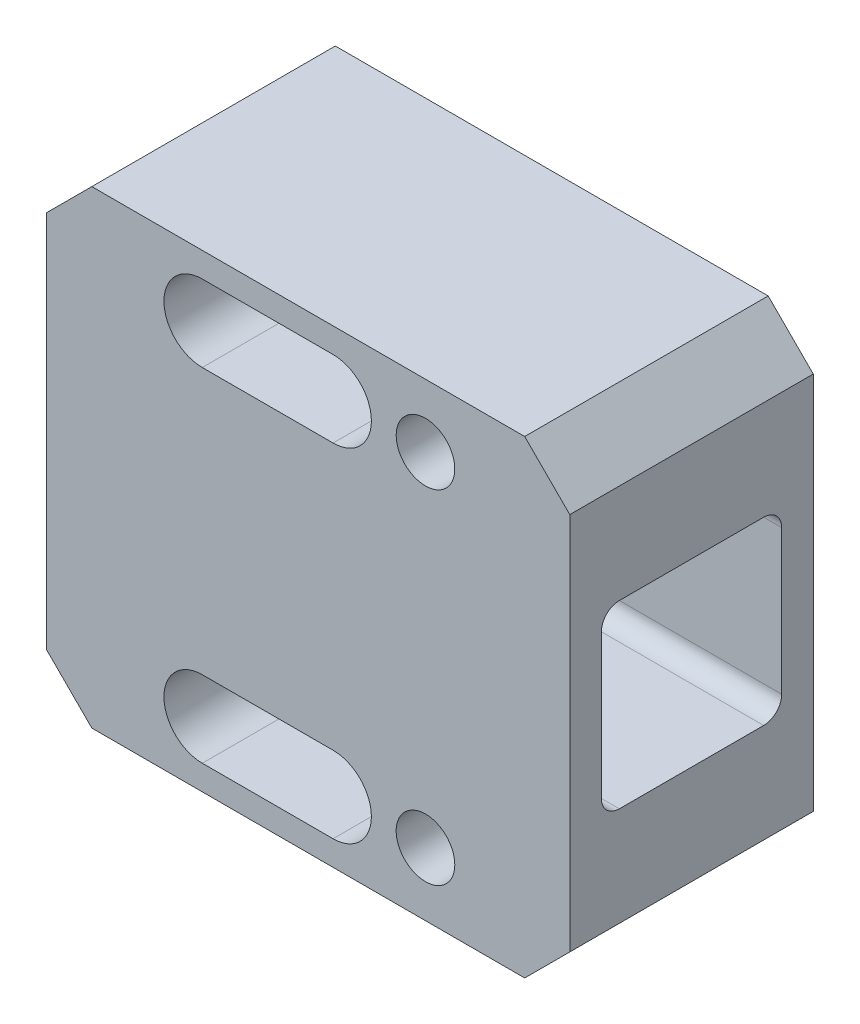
ISO-10303-21;
HEADER;
FILE_DESCRIPTION(('STEP AP214'),'2;1');
FILE_NAME('part.step','',(''),(''),'','','');
FILE_SCHEMA(('AUTOMOTIVE_DESIGN { 1 0 10303 214 1 1 1 1 }'));
ENDSEC;
DATA;
#1=APPLICATION_CONTEXT('core data for automotive mechanical design processes');
#2=APPLICATION_PROTOCOL_DEFINITION('international standard','automotive_design',2000,#1);
#3=PRODUCT_CONTEXT('',#1,'mechanical');
#4=PRODUCT('Part','Part','',(#3));
#5=PRODUCT_RELATED_PRODUCT_CATEGORY('part','',(#4));
#6=PRODUCT_DEFINITION_FORMATION('','',#4);
#7=PRODUCT_DEFINITION_CONTEXT('part definition',#1,'design');
#8=PRODUCT_DEFINITION('design','',#6,#7);
#9=PRODUCT_DEFINITION_SHAPE('','',#8);
#10=(LENGTH_UNIT() NAMED_UNIT(*) SI_UNIT(.MILLI.,.METRE.));
#11=(NAMED_UNIT(*) PLANE_ANGLE_UNIT() SI_UNIT($,.RADIAN.));
#12=(NAMED_UNIT(*) SI_UNIT($,.STERADIAN.) SOLID_ANGLE_UNIT());
#13=UNCERTAINTY_MEASURE_WITH_UNIT(LENGTH_MEASURE(1.E-05),#10,'distance_accuracy_value','');
#14=(GEOMETRIC_REPRESENTATION_CONTEXT(3) GLOBAL_UNCERTAINTY_ASSIGNED_CONTEXT((#13)) GLOBAL_UNIT_ASSIGNED_CONTEXT((#10,
#11,#12)) REPRESENTATION_CONTEXT('',''));
#15=CARTESIAN_POINT('',(0.,0.,0.));
#16=DIRECTION('',(0.,0.,1.));
#17=DIRECTION('',(1.,0.,0.));
#18=AXIS2_PLACEMENT_3D('',#15,#16,#17);
#19=CARTESIAN_POINT('',(-23.25,19.,13.5));
#20=DIRECTION('',(1.,0.,0.));
#21=DIRECTION('',(0.,1.,0.));
#22=AXIS2_PLACEMENT_3D('',#19,#20,#21);
#23=CYLINDRICAL_SURFACE('',#22,7.);
#24=CARTESIAN_POINT('',(-17.25,19.,13.5));
#25=DIRECTION('',(1.,0.,0.));
#26=DIRECTION('',(0.,1.,0.));
#27=AXIS2_PLACEMENT_3D('',#24,#25,#26);
#28=CIRCLE('',#27,7.);
#29=CARTESIAN_POINT('',(-17.25,26.,13.5));
#30=VERTEX_POINT('',#29);
#31=EDGE_CURVE('E9',#30,#30,#28,.F.);
#32=ORIENTED_EDGE('',*,*,#31,.T.);
#33=EDGE_LOOP('',(#32));
#34=FACE_BOUND('',#33,.T.);
#35=CARTESIAN_POINT('',(-22.25,19.,13.5));
#36=DIRECTION('',(-1.,0.,0.));
#37=DIRECTION('',(0.,0.,1.));
#38=AXIS2_PLACEMENT_3D('',#35,#36,#37);
#39=CIRCLE('',#38,7.);
#40=CARTESIAN_POINT('',(-22.25,19.,20.5));
#41=VERTEX_POINT('',#40);
#42=EDGE_CURVE('E249',#41,#41,#39,.T.);
#43=ORIENTED_EDGE('',*,*,#42,.F.);
#44=EDGE_LOOP('',(#43));
#45=FACE_BOUND('',#44,.T.);
#46=ADVANCED_FACE('F14',(#34,#45),#23,.T.);
#47=CARTESIAN_POINT('',(-17.25,45.,27.));
#48=DIRECTION('',(1.,0.,0.));
#49=DIRECTION('',(0.,1.,0.));
#50=AXIS2_PLACEMENT_3D('',#47,#48,#49);
#51=PLANE('',#50);
#52=DIRECTION('',(0.,-1.,0.));
#53=VECTOR('',#52,1.);
#54=CARTESIAN_POINT('',(-17.25,45.,27.));
#55=LINE('',#54,#53);
#56=CARTESIAN_POINT('',(-17.25,40.,27.));
#57=VERTEX_POINT('',#56);
#58=CARTESIAN_POINT('',(-17.25,-2.,27.));
#59=VERTEX_POINT('',#58);
#60=EDGE_CURVE('E326',#57,#59,#55,.T.);
#61=ORIENTED_EDGE('',*,*,#60,.F.);
#62=DIRECTION('',(0.,0.,-1.));
#63=VECTOR('',#62,1.);
#64=CARTESIAN_POINT('',(-17.25,40.,27.));
#65=LINE('',#64,#63);
#66=CARTESIAN_POINT('',(-17.25,40.,0.));
#67=VERTEX_POINT('',#66);
#68=EDGE_CURVE('E374',#57,#67,#65,.T.);
#69=ORIENTED_EDGE('',*,*,#68,.T.);
#70=DIRECTION('',(0.,-1.,0.));
#71=VECTOR('',#70,1.);
#72=CARTESIAN_POINT('',(-17.25,45.,0.));
#73=LINE('',#72,#71);
#74=CARTESIAN_POINT('',(-17.25,-2.,0.));
#75=VERTEX_POINT('',#74);
#76=EDGE_CURVE('E339',#67,#75,#73,.T.);
#77=ORIENTED_EDGE('',*,*,#76,.T.);
#78=DIRECTION('',(0.,0.,1.));
#79=VECTOR('',#78,1.);
#80=CARTESIAN_POINT('',(-17.25,-2.,27.));
#81=LINE('',#80,#79);
#82=EDGE_CURVE('E372',#75,#59,#81,.T.);
#83=ORIENTED_EDGE('',*,*,#82,.T.);
#84=EDGE_LOOP('',(#61,#69,#77,#83));
#85=FACE_BOUND('',#84,.T.);
#86=ORIENTED_EDGE('',*,*,#31,.F.);
#87=EDGE_LOOP('',(#86));
#88=FACE_BOUND('',#87,.T.);
#89=ADVANCED_FACE('F414',(#85,#88),#51,.F.);
#90=CARTESIAN_POINT('',(-17.25,45.,27.));
#91=DIRECTION('',(0.,0.,1.));
#92=DIRECTION('',(-1.,0.,0.));
#93=AXIS2_PLACEMENT_3D('',#90,#91,#92);
#94=PLANE('',#93);
#95=CARTESIAN_POINT('',(0.,38.,27.));
#96=DIRECTION('',(0.,0.,1.));
#97=DIRECTION('',(-1.,0.,0.));
#98=AXIS2_PLACEMENT_3D('',#95,#96,#97);
#99=CIRCLE('',#98,4.25);
#100=CARTESIAN_POINT('',(0.,42.25,27.));
#101=VERTEX_POINT('',#100);
#102=CARTESIAN_POINT('',(0.,33.75,27.));
#103=VERTEX_POINT('',#102);
#104=EDGE_CURVE('E29',#101,#103,#99,.T.);
#105=ORIENTED_EDGE('',*,*,#104,.F.);
#106=DIRECTION('',(-1.,0.,0.));
#107=VECTOR('',#106,1.);
#108=CARTESIAN_POINT('',(0.,42.25,27.));
#109=LINE('',#108,#107);
#110=CARTESIAN_POINT('',(14.5,42.25,27.));
#111=VERTEX_POINT('',#110);
#112=EDGE_CURVE('E193',#111,#101,#109,.T.);
#113=ORIENTED_EDGE('',*,*,#112,.F.);
#114=CARTESIAN_POINT('',(14.5,38.,27.));
#115=DIRECTION('',(0.,0.,1.));
#116=DIRECTION('',(-1.,0.,0.));
#117=AXIS2_PLACEMENT_3D('',#114,#115,#116);
#118=CIRCLE('',#117,4.25);
#119=CARTESIAN_POINT('',(14.5,33.75,27.));
#120=VERTEX_POINT('',#119);
#121=EDGE_CURVE('E196',#120,#111,#118,.T.);
#122=ORIENTED_EDGE('',*,*,#121,.F.);
#123=DIRECTION('',(1.,0.,0.));
#124=VECTOR('',#123,1.);
#125=CARTESIAN_POINT('',(0.,33.75,27.));
#126=LINE('',#125,#124);
#127=EDGE_CURVE('E202',#103,#120,#126,.T.);
#128=ORIENTED_EDGE('',*,*,#127,.F.);
#129=EDGE_LOOP('',(#105,#113,#122,#128));
#130=FACE_BOUND('',#129,.T.);
#131=CARTESIAN_POINT('',(24.75,38.,27.));
#132=DIRECTION('',(0.,0.,1.));
#133=DIRECTION('',(-1.,0.,0.));
#134=AXIS2_PLACEMENT_3D('',#131,#132,#133);
#135=CIRCLE('',#134,3.25);
#136=CARTESIAN_POINT('',(21.5,38.,27.));
#137=VERTEX_POINT('',#136);
#138=EDGE_CURVE('E208',#137,#137,#135,.T.);
#139=ORIENTED_EDGE('',*,*,#138,.F.);
#140=EDGE_LOOP('',(#139));
#141=FACE_BOUND('',#140,.T.);
#142=CARTESIAN_POINT('',(24.75,0.,27.));
#143=DIRECTION('',(0.,0.,1.));
#144=DIRECTION('',(1.,0.,0.));
#145=AXIS2_PLACEMENT_3D('',#142,#143,#144);
#146=CIRCLE('',#145,3.25);
#147=CARTESIAN_POINT('',(28.,0.,27.));
#148=VERTEX_POINT('',#147);
#149=EDGE_CURVE('E215',#148,#148,#146,.T.);
#150=ORIENTED_EDGE('',*,*,#149,.F.);
#151=EDGE_LOOP('',(#150));
#152=FACE_BOUND('',#151,.T.);
#153=CARTESIAN_POINT('',(0.,0.,27.));
#154=DIRECTION('',(0.,0.,1.));
#155=DIRECTION('',(1.,0.,0.));
#156=AXIS2_PLACEMENT_3D('',#153,#154,#155);
#157=CIRCLE('',#156,4.25);
#158=CARTESIAN_POINT('',(0.,4.25,27.));
#159=VERTEX_POINT('',#158);
#160=CARTESIAN_POINT('',(0.,-4.25,27.));
#161=VERTEX_POINT('',#160);
#162=EDGE_CURVE('E221',#159,#161,#157,.T.);
#163=ORIENTED_EDGE('',*,*,#162,.F.);
#164=DIRECTION('',(-1.,0.,0.));
#165=VECTOR('',#164,1.);
#166=CARTESIAN_POINT('',(0.,4.25,27.));
#167=LINE('',#166,#165);
#168=CARTESIAN_POINT('',(14.5,4.25,27.));
#169=VERTEX_POINT('',#168);
#170=EDGE_CURVE('E228',#169,#159,#167,.T.);
#171=ORIENTED_EDGE('',*,*,#170,.F.);
#172=CARTESIAN_POINT('',(14.5,0.,27.));
#173=DIRECTION('',(0.,0.,1.));
#174=DIRECTION('',(1.,0.,0.));
#175=AXIS2_PLACEMENT_3D('',#172,#173,#174);
#176=CIRCLE('',#175,4.25);
#177=CARTESIAN_POINT('',(14.5,-4.25,27.));
#178=VERTEX_POINT('',#177);
#179=EDGE_CURVE('E242',#178,#169,#176,.T.);
#180=ORIENTED_EDGE('',*,*,#179,.F.);
#181=DIRECTION('',(1.,0.,0.));
#182=VECTOR('',#181,1.);
#183=CARTESIAN_POINT('',(0.,-4.25,27.));
#184=LINE('',#183,#182);
#185=EDGE_CURVE('E239',#161,#178,#184,.T.);
#186=ORIENTED_EDGE('',*,*,#185,.F.);
#187=EDGE_LOOP('',(#163,#171,#180,#186));
#188=FACE_BOUND('',#187,.T.);
#189=DIRECTION('',(0.,1.,0.));
#190=VECTOR('',#189,1.);
#191=CARTESIAN_POINT('',(40.75,45.,27.));
#192=LINE('',#191,#190);
#193=CARTESIAN_POINT('',(40.75,-2.,27.));
#194=VERTEX_POINT('',#193);
#195=CARTESIAN_POINT('',(40.75,40.,27.));
#196=VERTEX_POINT('',#195);
#197=EDGE_CURVE('E333',#194,#196,#192,.T.);
#198=ORIENTED_EDGE('',*,*,#197,.T.);
#199=DIRECTION('',(0.707106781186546,-0.707106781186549,0.));
#200=VECTOR('',#199,1.);
#201=CARTESIAN_POINT('',(9.25000000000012,71.5,27.));
#202=LINE('',#201,#200);
#203=CARTESIAN_POINT('',(35.75,45.,27.));
#204=VERTEX_POINT('',#203);
#205=EDGE_CURVE('E370',#196,#204,#202,.F.);
#206=ORIENTED_EDGE('',*,*,#205,.T.);
#207=DIRECTION('',(-1.,0.,0.));
#208=VECTOR('',#207,1.);
#209=CARTESIAN_POINT('',(40.75,45.,27.));
#210=LINE('',#209,#208);
#211=CARTESIAN_POINT('',(-12.25,45.,27.));
#212=VERTEX_POINT('',#211);
#213=EDGE_CURVE('E323',#204,#212,#210,.T.);
#214=ORIENTED_EDGE('',*,*,#213,.T.);
#215=DIRECTION('',(0.707106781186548,0.707106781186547,0.));
#216=VECTOR('',#215,1.);
#217=CARTESIAN_POINT('',(-14.75,42.5,27.));
#218=LINE('',#217,#216);
#219=EDGE_CURVE('E368',#212,#57,#218,.F.);
#220=ORIENTED_EDGE('',*,*,#219,.T.);
#221=ORIENTED_EDGE('',*,*,#60,.T.);
#222=DIRECTION('',(-0.707106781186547,0.707106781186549,0.));
#223=VECTOR('',#222,1.);
#224=CARTESIAN_POINT('',(-40.75,21.5,27.));
#225=LINE('',#224,#223);
#226=CARTESIAN_POINT('',(-12.25,-7.,27.));
#227=VERTEX_POINT('',#226);
#228=EDGE_CURVE('E366',#59,#227,#225,.F.);
#229=ORIENTED_EDGE('',*,*,#228,.T.);
#230=DIRECTION('',(1.,0.,0.));
#231=VECTOR('',#230,1.);
#232=CARTESIAN_POINT('',(40.75,-7.,27.));
#233=LINE('',#232,#231);
#234=CARTESIAN_POINT('',(35.75,-7.,27.));
#235=VERTEX_POINT('',#234);
#236=EDGE_CURVE('E330',#227,#235,#233,.T.);
#237=ORIENTED_EDGE('',*,*,#236,.T.);
#238=DIRECTION('',(-0.707106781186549,-0.707106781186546,0.));
#239=VECTOR('',#238,1.);
#240=CARTESIAN_POINT('',(35.25,-7.5,27.));
#241=LINE('',#240,#239);
#242=EDGE_CURVE('E364',#235,#194,#241,.F.);
#243=ORIENTED_EDGE('',*,*,#242,.T.);
#244=EDGE_LOOP('',(#198,#206,#214,#220,#221,#229,#237,#243));
#245=FACE_BOUND('',#244,.T.);
#246=ADVANCED_FACE('F400',(#130,#141,#152,#188,#245),#94,.T.);
#247=CARTESIAN_POINT('',(-17.25,45.,0.));
#248=DIRECTION('',(0.,0.,1.));
#249=DIRECTION('',(-1.,0.,0.));
#250=AXIS2_PLACEMENT_3D('',#247,#248,#249);
#251=PLANE('',#250);
#252=DIRECTION('',(-1.,0.,0.));
#253=VECTOR('',#252,1.);
#254=CARTESIAN_POINT('',(0.,42.25,0.));
#255=LINE('',#254,#253);
#256=CARTESIAN_POINT('',(14.5,42.25,0.));
#257=VERTEX_POINT('',#256);
#258=CARTESIAN_POINT('',(0.,42.25,0.));
#259=VERTEX_POINT('',#258);
#260=EDGE_CURVE('E183',#257,#259,#255,.T.);
#261=ORIENTED_EDGE('',*,*,#260,.T.);
#262=CARTESIAN_POINT('',(0.,38.,0.));
#263=DIRECTION('',(0.,0.,1.));
#264=DIRECTION('',(-1.,0.,0.));
#265=AXIS2_PLACEMENT_3D('',#262,#263,#264);
#266=CIRCLE('',#265,4.25);
#267=CARTESIAN_POINT('',(0.,33.75,0.));
#268=VERTEX_POINT('',#267);
#269=EDGE_CURVE('E177',#259,#268,#266,.T.);
#270=ORIENTED_EDGE('',*,*,#269,.T.);
#271=DIRECTION('',(1.,0.,0.));
#272=VECTOR('',#271,1.);
#273=CARTESIAN_POINT('',(0.,33.75,0.));
#274=LINE('',#273,#272);
#275=CARTESIAN_POINT('',(14.5,33.75,0.));
#276=VERTEX_POINT('',#275);
#277=EDGE_CURVE('E186',#268,#276,#274,.T.);
#278=ORIENTED_EDGE('',*,*,#277,.T.);
#279=CARTESIAN_POINT('',(14.5,38.,0.));
#280=DIRECTION('',(0.,0.,1.));
#281=DIRECTION('',(-1.,0.,0.));
#282=AXIS2_PLACEMENT_3D('',#279,#280,#281);
#283=CIRCLE('',#282,4.25);
#284=EDGE_CURVE('E37',#276,#257,#283,.T.);
#285=ORIENTED_EDGE('',*,*,#284,.T.);
#286=EDGE_LOOP('',(#261,#270,#278,#285));
#287=FACE_BOUND('',#286,.T.);
#288=CARTESIAN_POINT('',(24.75,38.,0.));
#289=DIRECTION('',(0.,0.,1.));
#290=DIRECTION('',(-1.,0.,0.));
#291=AXIS2_PLACEMENT_3D('',#288,#289,#290);
#292=CIRCLE('',#291,3.25);
#293=CARTESIAN_POINT('',(21.5,38.,0.));
#294=VERTEX_POINT('',#293);
#295=EDGE_CURVE('E212',#294,#294,#292,.T.);
#296=ORIENTED_EDGE('',*,*,#295,.T.);
#297=EDGE_LOOP('',(#296));
#298=FACE_BOUND('',#297,.T.);
#299=CARTESIAN_POINT('',(24.75,0.,0.));
#300=DIRECTION('',(0.,0.,1.));
#301=DIRECTION('',(1.,0.,0.));
#302=AXIS2_PLACEMENT_3D('',#299,#300,#301);
#303=CIRCLE('',#302,3.25);
#304=CARTESIAN_POINT('',(28.,0.,0.));
#305=VERTEX_POINT('',#304);
#306=EDGE_CURVE('E218',#305,#305,#303,.T.);
#307=ORIENTED_EDGE('',*,*,#306,.T.);
#308=EDGE_LOOP('',(#307));
#309=FACE_BOUND('',#308,.T.);
#310=DIRECTION('',(-1.,0.,0.));
#311=VECTOR('',#310,1.);
#312=CARTESIAN_POINT('',(0.,4.25,0.));
#313=LINE('',#312,#311);
#314=CARTESIAN_POINT('',(14.5,4.25,0.));
#315=VERTEX_POINT('',#314);
#316=CARTESIAN_POINT('',(0.,4.25,0.));
#317=VERTEX_POINT('',#316);
#318=EDGE_CURVE('E234',#315,#317,#313,.T.);
#319=ORIENTED_EDGE('',*,*,#318,.T.);
#320=CARTESIAN_POINT('',(0.,0.,0.));
#321=DIRECTION('',(0.,0.,1.));
#322=DIRECTION('',(1.,0.,0.));
#323=AXIS2_PLACEMENT_3D('',#320,#321,#322);
#324=CIRCLE('',#323,4.25);
#325=CARTESIAN_POINT('',(0.,-4.25,0.));
#326=VERTEX_POINT('',#325);
#327=EDGE_CURVE('E224',#317,#326,#324,.T.);
#328=ORIENTED_EDGE('',*,*,#327,.T.);
#329=DIRECTION('',(1.,0.,0.));
#330=VECTOR('',#329,1.);
#331=CARTESIAN_POINT('',(0.,-4.25,0.));
#332=LINE('',#331,#330);
#333=CARTESIAN_POINT('',(14.5,-4.25,0.));
#334=VERTEX_POINT('',#333);
#335=EDGE_CURVE('E227',#326,#334,#332,.T.);
#336=ORIENTED_EDGE('',*,*,#335,.T.);
#337=CARTESIAN_POINT('',(14.5,0.,0.));
#338=DIRECTION('',(0.,0.,1.));
#339=DIRECTION('',(1.,0.,0.));
#340=AXIS2_PLACEMENT_3D('',#337,#338,#339);
#341=CIRCLE('',#340,4.25);
#342=EDGE_CURVE('E231',#334,#315,#341,.T.);
#343=ORIENTED_EDGE('',*,*,#342,.T.);
#344=EDGE_LOOP('',(#319,#328,#336,#343));
#345=FACE_BOUND('',#344,.T.);
#346=DIRECTION('',(-1.,0.,0.));
#347=VECTOR('',#346,1.);
#348=CARTESIAN_POINT('',(40.75,45.,0.));
#349=LINE('',#348,#347);
#350=CARTESIAN_POINT('',(35.75,45.,0.));
#351=VERTEX_POINT('',#350);
#352=CARTESIAN_POINT('',(-12.25,45.,0.));
#353=VERTEX_POINT('',#352);
#354=EDGE_CURVE('E308',#351,#353,#349,.T.);
#355=ORIENTED_EDGE('',*,*,#354,.F.);
#356=DIRECTION('',(-0.707106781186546,0.707106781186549,0.));
#357=VECTOR('',#356,1.);
#358=CARTESIAN_POINT('',(35.75,45.,0.));
#359=LINE('',#358,#357);
#360=CARTESIAN_POINT('',(40.75,40.,0.));
#361=VERTEX_POINT('',#360);
#362=EDGE_CURVE('E357',#351,#361,#359,.F.);
#363=ORIENTED_EDGE('',*,*,#362,.T.);
#364=DIRECTION('',(0.,1.,0.));
#365=VECTOR('',#364,1.);
#366=CARTESIAN_POINT('',(40.75,45.,0.));
#367=LINE('',#366,#365);
#368=CARTESIAN_POINT('',(40.75,-2.,0.));
#369=VERTEX_POINT('',#368);
#370=EDGE_CURVE('E327',#369,#361,#367,.T.);
#371=ORIENTED_EDGE('',*,*,#370,.F.);
#372=DIRECTION('',(0.707106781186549,0.707106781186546,0.));
#373=VECTOR('',#372,1.);
#374=CARTESIAN_POINT('',(40.75,-2.,0.));
#375=LINE('',#374,#373);
#376=CARTESIAN_POINT('',(35.75,-7.,0.));
#377=VERTEX_POINT('',#376);
#378=EDGE_CURVE('E351',#369,#377,#375,.F.);
#379=ORIENTED_EDGE('',*,*,#378,.T.);
#380=DIRECTION('',(1.,0.,0.));
#381=VECTOR('',#380,1.);
#382=CARTESIAN_POINT('',(40.75,-7.,0.));
#383=LINE('',#382,#381);
#384=CARTESIAN_POINT('',(-12.25,-7.,0.));
#385=VERTEX_POINT('',#384);
#386=EDGE_CURVE('E342',#385,#377,#383,.T.);
#387=ORIENTED_EDGE('',*,*,#386,.F.);
#388=DIRECTION('',(0.707106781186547,-0.707106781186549,0.));
#389=VECTOR('',#388,1.);
#390=CARTESIAN_POINT('',(-12.25,-7.,0.));
#391=LINE('',#390,#389);
#392=EDGE_CURVE('E353',#385,#75,#391,.F.);
#393=ORIENTED_EDGE('',*,*,#392,.T.);
#394=ORIENTED_EDGE('',*,*,#76,.F.);
#395=DIRECTION('',(-0.707106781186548,-0.707106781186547,0.));
#396=VECTOR('',#395,1.);
#397=CARTESIAN_POINT('',(-17.25,40.,0.));
#398=LINE('',#397,#396);
#399=EDGE_CURVE('E355',#67,#353,#398,.F.);
#400=ORIENTED_EDGE('',*,*,#399,.T.);
#401=EDGE_LOOP('',(#355,#363,#371,#379,#387,#393,#394,#400));
#402=FACE_BOUND('',#401,.T.);
#403=ADVANCED_FACE('F190',(#287,#298,#309,#345,#402),#251,.F.);
#404=CARTESIAN_POINT('',(40.75,45.,27.));
#405=DIRECTION('',(0.,-1.,0.));
#406=DIRECTION('',(1.,0.,0.));
#407=AXIS2_PLACEMENT_3D('',#404,#405,#406);
#408=PLANE('',#407);
#409=ORIENTED_EDGE('',*,*,#213,.F.);
#410=DIRECTION('',(0.,0.,-1.));
#411=VECTOR('',#410,1.);
#412=CARTESIAN_POINT('',(35.75,45.,27.));
#413=LINE('',#412,#411);
#414=EDGE_CURVE('E348',#204,#351,#413,.T.);
#415=ORIENTED_EDGE('',*,*,#414,.T.);
#416=ORIENTED_EDGE('',*,*,#354,.T.);
#417=DIRECTION('',(0.,0.,1.));
#418=VECTOR('',#417,1.);
#419=CARTESIAN_POINT('',(-12.25,45.,27.));
#420=LINE('',#419,#418);
#421=EDGE_CURVE('E336',#353,#212,#420,.T.);
#422=ORIENTED_EDGE('',*,*,#421,.T.);
#423=EDGE_LOOP('',(#409,#415,#416,#422));
#424=FACE_BOUND('',#423,.T.);
#425=ADVANCED_FACE('F406',(#424),#408,.F.);
#426=CARTESIAN_POINT('',(40.75,-7.,27.));
#427=DIRECTION('',(0.,1.,0.));
#428=DIRECTION('',(-1.,0.,0.));
#429=AXIS2_PLACEMENT_3D('',#426,#427,#428);
#430=PLANE('',#429);
#431=ORIENTED_EDGE('',*,*,#236,.F.);
#432=DIRECTION('',(0.,0.,-1.));
#433=VECTOR('',#432,1.);
#434=CARTESIAN_POINT('',(-12.25,-7.,27.));
#435=LINE('',#434,#433);
#436=EDGE_CURVE('E22',#227,#385,#435,.T.);
#437=ORIENTED_EDGE('',*,*,#436,.T.);
#438=ORIENTED_EDGE('',*,*,#386,.T.);
#439=DIRECTION('',(0.,0.,1.));
#440=VECTOR('',#439,1.);
#441=CARTESIAN_POINT('',(35.75,-7.,27.));
#442=LINE('',#441,#440);
#443=EDGE_CURVE('E377',#377,#235,#442,.T.);
#444=ORIENTED_EDGE('',*,*,#443,.T.);
#445=EDGE_LOOP('',(#431,#437,#438,#444));
#446=FACE_BOUND('',#445,.T.);
#447=ADVANCED_FACE('F383',(#446),#430,.F.);
#448=CARTESIAN_POINT('',(40.75,45.,27.));
#449=DIRECTION('',(-1.,0.,0.));
#450=DIRECTION('',(0.,-1.,0.));
#451=AXIS2_PLACEMENT_3D('',#448,#449,#450);
#452=PLANE('',#451);
#453=DIRECTION('',(0.,0.,1.));
#454=VECTOR('',#453,1.);
#455=CARTESIAN_POINT('',(40.75,29.,5.5));
#456=LINE('',#455,#454);
#457=CARTESIAN_POINT('',(40.75,29.,5.5));
#458=VERTEX_POINT('',#457);
#459=CARTESIAN_POINT('',(40.75,29.,21.5));
#460=VERTEX_POINT('',#459);
#461=EDGE_CURVE('E284',#458,#460,#456,.T.);
#462=ORIENTED_EDGE('',*,*,#461,.F.);
#463=CARTESIAN_POINT('',(40.75,27.,5.5));
#464=DIRECTION('',(1.,0.,0.));
#465=DIRECTION('',(0.,-1.,0.));
#466=AXIS2_PLACEMENT_3D('',#463,#464,#465);
#467=CIRCLE('',#466,2.);
#468=CARTESIAN_POINT('',(40.75,27.,3.5));
#469=VERTEX_POINT('',#468);
#470=EDGE_CURVE('E282',#469,#458,#467,.T.);
#471=ORIENTED_EDGE('',*,*,#470,.F.);
#472=DIRECTION('',(0.,1.,0.));
#473=VECTOR('',#472,1.);
#474=CARTESIAN_POINT('',(40.75,27.,3.5));
#475=LINE('',#474,#473);
#476=CARTESIAN_POINT('',(40.75,11.,3.5));
#477=VERTEX_POINT('',#476);
#478=EDGE_CURVE('E302',#477,#469,#475,.T.);
#479=ORIENTED_EDGE('',*,*,#478,.F.);
#480=CARTESIAN_POINT('',(40.75,11.,5.5));
#481=DIRECTION('',(1.,0.,0.));
#482=DIRECTION('',(0.,-1.,0.));
#483=AXIS2_PLACEMENT_3D('',#480,#481,#482);
#484=CIRCLE('',#483,2.);
#485=CARTESIAN_POINT('',(40.75,9.,5.5));
#486=VERTEX_POINT('',#485);
#487=EDGE_CURVE('E299',#486,#477,#484,.T.);
#488=ORIENTED_EDGE('',*,*,#487,.F.);
#489=DIRECTION('',(0.,0.,-1.));
#490=VECTOR('',#489,1.);
#491=CARTESIAN_POINT('',(40.75,9.,5.5));
#492=LINE('',#491,#490);
#493=CARTESIAN_POINT('',(40.75,9.,21.5));
#494=VERTEX_POINT('',#493);
#495=EDGE_CURVE('E296',#494,#486,#492,.T.);
#496=ORIENTED_EDGE('',*,*,#495,.F.);
#497=CARTESIAN_POINT('',(40.75,11.,21.5));
#498=DIRECTION('',(1.,0.,0.));
#499=DIRECTION('',(0.,-1.,0.));
#500=AXIS2_PLACEMENT_3D('',#497,#498,#499);
#501=CIRCLE('',#500,2.);
#502=CARTESIAN_POINT('',(40.75,11.,23.5));
#503=VERTEX_POINT('',#502);
#504=EDGE_CURVE('E293',#503,#494,#501,.T.);
#505=ORIENTED_EDGE('',*,*,#504,.F.);
#506=DIRECTION('',(0.,-1.,0.));
#507=VECTOR('',#506,1.);
#508=CARTESIAN_POINT('',(40.75,27.,23.5));
#509=LINE('',#508,#507);
#510=CARTESIAN_POINT('',(40.75,27.,23.5));
#511=VERTEX_POINT('',#510);
#512=EDGE_CURVE('E290',#511,#503,#509,.T.);
#513=ORIENTED_EDGE('',*,*,#512,.F.);
#514=CARTESIAN_POINT('',(40.75,27.,21.5));
#515=DIRECTION('',(1.,0.,0.));
#516=DIRECTION('',(0.,-1.,0.));
#517=AXIS2_PLACEMENT_3D('',#514,#515,#516);
#518=CIRCLE('',#517,2.);
#519=EDGE_CURVE('E287',#460,#511,#518,.T.);
#520=ORIENTED_EDGE('',*,*,#519,.F.);
#521=EDGE_LOOP('',(#462,#471,#479,#488,#496,#505,#513,#520));
#522=FACE_BOUND('',#521,.T.);
#523=ORIENTED_EDGE('',*,*,#370,.T.);
#524=DIRECTION('',(0.,0.,1.));
#525=VECTOR('',#524,1.);
#526=CARTESIAN_POINT('',(40.75,40.,27.));
#527=LINE('',#526,#525);
#528=EDGE_CURVE('E362',#361,#196,#527,.T.);
#529=ORIENTED_EDGE('',*,*,#528,.T.);
#530=ORIENTED_EDGE('',*,*,#197,.F.);
#531=DIRECTION('',(0.,0.,-1.));
#532=VECTOR('',#531,1.);
#533=CARTESIAN_POINT('',(40.75,-2.,27.));
#534=LINE('',#533,#532);
#535=EDGE_CURVE('E359',#194,#369,#534,.T.);
#536=ORIENTED_EDGE('',*,*,#535,.T.);
#537=EDGE_LOOP('',(#523,#529,#530,#536));
#538=FACE_BOUND('',#537,.T.);
#539=ADVANCED_FACE('F396',(#522,#538),#452,.F.);
#540=CARTESIAN_POINT('',(35.75,45.,27.));
#541=DIRECTION('',(-0.707106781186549,-0.707106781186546,0.));
#542=DIRECTION('',(0.707106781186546,-0.707106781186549,0.));
#543=AXIS2_PLACEMENT_3D('',#540,#541,#542);
#544=PLANE('',#543);
#545=ORIENTED_EDGE('',*,*,#205,.F.);
#546=ORIENTED_EDGE('',*,*,#528,.F.);
#547=ORIENTED_EDGE('',*,*,#362,.F.);
#548=ORIENTED_EDGE('',*,*,#414,.F.);
#549=EDGE_LOOP('',(#545,#546,#547,#548));
#550=FACE_BOUND('',#549,.T.);
#551=ADVANCED_FACE('F404',(#550),#544,.F.);
#552=CARTESIAN_POINT('',(-17.25,40.,27.));
#553=DIRECTION('',(0.707106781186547,-0.707106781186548,0.));
#554=DIRECTION('',(0.707106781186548,0.707106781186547,0.));
#555=AXIS2_PLACEMENT_3D('',#552,#553,#554);
#556=PLANE('',#555);
#557=ORIENTED_EDGE('',*,*,#219,.F.);
#558=ORIENTED_EDGE('',*,*,#421,.F.);
#559=ORIENTED_EDGE('',*,*,#399,.F.);
#560=ORIENTED_EDGE('',*,*,#68,.F.);
#561=EDGE_LOOP('',(#557,#558,#559,#560));
#562=FACE_BOUND('',#561,.T.);
#563=ADVANCED_FACE('F411',(#562),#556,.F.);
#564=CARTESIAN_POINT('',(-12.25,-7.,27.));
#565=DIRECTION('',(0.707106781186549,0.707106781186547,0.));
#566=DIRECTION('',(-0.707106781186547,0.707106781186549,0.));
#567=AXIS2_PLACEMENT_3D('',#564,#565,#566);
#568=PLANE('',#567);
#569=ORIENTED_EDGE('',*,*,#228,.F.);
#570=ORIENTED_EDGE('',*,*,#82,.F.);
#571=ORIENTED_EDGE('',*,*,#392,.F.);
#572=ORIENTED_EDGE('',*,*,#436,.F.);
#573=EDGE_LOOP('',(#569,#570,#571,#572));
#574=FACE_BOUND('',#573,.T.);
#575=ADVANCED_FACE('F417',(#574),#568,.F.);
#576=CARTESIAN_POINT('',(40.75,-2.,27.));
#577=DIRECTION('',(-0.707106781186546,0.707106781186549,0.));
#578=DIRECTION('',(-0.707106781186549,-0.707106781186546,0.));
#579=AXIS2_PLACEMENT_3D('',#576,#577,#578);
#580=PLANE('',#579);
#581=ORIENTED_EDGE('',*,*,#242,.F.);
#582=ORIENTED_EDGE('',*,*,#443,.F.);
#583=ORIENTED_EDGE('',*,*,#378,.F.);
#584=ORIENTED_EDGE('',*,*,#535,.F.);
#585=EDGE_LOOP('',(#581,#582,#583,#584));
#586=FACE_BOUND('',#585,.T.);
#587=ADVANCED_FACE('F16',(#586),#580,.F.);
#588=CARTESIAN_POINT('',(0.75,27.,5.5));
#589=DIRECTION('',(1.,0.,0.));
#590=DIRECTION('',(0.,1.,0.));
#591=AXIS2_PLACEMENT_3D('',#588,#589,#590);
#592=CYLINDRICAL_SURFACE('',#591,2.);
#593=ORIENTED_EDGE('',*,*,#470,.T.);
#594=DIRECTION('',(1.,0.,0.));
#595=VECTOR('',#594,1.);
#596=CARTESIAN_POINT('',(0.75,29.,5.5));
#597=LINE('',#596,#595);
#598=CARTESIAN_POINT('',(-4.25,29.,5.5));
#599=VERTEX_POINT('',#598);
#600=EDGE_CURVE('E305',#599,#458,#597,.T.);
#601=ORIENTED_EDGE('',*,*,#600,.F.);
#602=CARTESIAN_POINT('',(-4.25,27.,5.5));
#603=DIRECTION('',(1.,0.,0.));
#604=DIRECTION('',(0.,1.,0.));
#605=AXIS2_PLACEMENT_3D('',#602,#603,#604);
#606=CIRCLE('',#605,2.);
#607=CARTESIAN_POINT('',(-4.25,27.,3.5));
#608=VERTEX_POINT('',#607);
#609=EDGE_CURVE('E258',#608,#599,#606,.T.);
#610=ORIENTED_EDGE('',*,*,#609,.F.);
#611=DIRECTION('',(1.,0.,0.));
#612=VECTOR('',#611,1.);
#613=CARTESIAN_POINT('',(0.75,27.,3.5));
#614=LINE('',#613,#612);
#615=EDGE_CURVE('E306',#608,#469,#614,.T.);
#616=ORIENTED_EDGE('',*,*,#615,.T.);
#617=EDGE_LOOP('',(#593,#601,#610,#616));
#618=FACE_BOUND('',#617,.T.);
#619=ADVANCED_FACE('F425',(#618),#592,.F.);
#620=CARTESIAN_POINT('',(0.75,27.,3.5));
#621=DIRECTION('',(0.,0.,-1.));
#622=DIRECTION('',(0.,-1.,0.));
#623=AXIS2_PLACEMENT_3D('',#620,#621,#622);
#624=PLANE('',#623);
#625=ORIENTED_EDGE('',*,*,#478,.T.);
#626=ORIENTED_EDGE('',*,*,#615,.F.);
#627=DIRECTION('',(0.,1.,0.));
#628=VECTOR('',#627,1.);
#629=CARTESIAN_POINT('',(-4.25,11.,3.5));
#630=LINE('',#629,#628);
#631=CARTESIAN_POINT('',(-4.25,11.,3.5));
#632=VERTEX_POINT('',#631);
#633=EDGE_CURVE('E279',#632,#608,#630,.T.);
#634=ORIENTED_EDGE('',*,*,#633,.F.);
#635=DIRECTION('',(1.,0.,0.));
#636=VECTOR('',#635,1.);
#637=CARTESIAN_POINT('',(0.75,11.,3.5));
#638=LINE('',#637,#636);
#639=EDGE_CURVE('E309',#632,#477,#638,.T.);
#640=ORIENTED_EDGE('',*,*,#639,.T.);
#641=EDGE_LOOP('',(#625,#626,#634,#640));
#642=FACE_BOUND('',#641,.T.);
#643=ADVANCED_FACE('F525',(#642),#624,.F.);
#644=CARTESIAN_POINT('',(0.75,11.,5.5));
#645=DIRECTION('',(1.,0.,0.));
#646=DIRECTION('',(0.,1.,0.));
#647=AXIS2_PLACEMENT_3D('',#644,#645,#646);
#648=CYLINDRICAL_SURFACE('',#647,2.);
#649=ORIENTED_EDGE('',*,*,#487,.T.);
#650=ORIENTED_EDGE('',*,*,#639,.F.);
#651=CARTESIAN_POINT('',(-4.25,11.,5.5));
#652=DIRECTION('',(1.,0.,0.));
#653=DIRECTION('',(0.,1.,0.));
#654=AXIS2_PLACEMENT_3D('',#651,#652,#653);
#655=CIRCLE('',#654,2.);
#656=CARTESIAN_POINT('',(-4.25,9.,5.5));
#657=VERTEX_POINT('',#656);
#658=EDGE_CURVE('E276',#657,#632,#655,.T.);
#659=ORIENTED_EDGE('',*,*,#658,.F.);
#660=DIRECTION('',(1.,0.,0.));
#661=VECTOR('',#660,1.);
#662=CARTESIAN_POINT('',(0.75,9.,5.5));
#663=LINE('',#662,#661);
#664=EDGE_CURVE('E311',#657,#486,#663,.T.);
#665=ORIENTED_EDGE('',*,*,#664,.T.);
#666=EDGE_LOOP('',(#649,#650,#659,#665));
#667=FACE_BOUND('',#666,.T.);
#668=ADVANCED_FACE('F532',(#667),#648,.F.);
#669=CARTESIAN_POINT('',(0.75,9.,5.5));
#670=DIRECTION('',(0.,-1.,0.));
#671=DIRECTION('',(0.,0.,1.));
#672=AXIS2_PLACEMENT_3D('',#669,#670,#671);
#673=PLANE('',#672);
#674=ORIENTED_EDGE('',*,*,#495,.T.);
#675=ORIENTED_EDGE('',*,*,#664,.F.);
#676=DIRECTION('',(0.,0.,-1.));
#677=VECTOR('',#676,1.);
#678=CARTESIAN_POINT('',(-4.25,9.,21.5));
#679=LINE('',#678,#677);
#680=CARTESIAN_POINT('',(-4.25,9.,21.5));
#681=VERTEX_POINT('',#680);
#682=EDGE_CURVE('E273',#681,#657,#679,.T.);
#683=ORIENTED_EDGE('',*,*,#682,.F.);
#684=DIRECTION('',(1.,0.,0.));
#685=VECTOR('',#684,1.);
#686=CARTESIAN_POINT('',(0.75,9.,21.5));
#687=LINE('',#686,#685);
#688=EDGE_CURVE('E313',#681,#494,#687,.T.);
#689=ORIENTED_EDGE('',*,*,#688,.T.);
#690=EDGE_LOOP('',(#674,#675,#683,#689));
#691=FACE_BOUND('',#690,.T.);
#692=ADVANCED_FACE('F541',(#691),#673,.F.);
#693=CARTESIAN_POINT('',(0.75,11.,21.5));
#694=DIRECTION('',(1.,0.,0.));
#695=DIRECTION('',(0.,1.,0.));
#696=AXIS2_PLACEMENT_3D('',#693,#694,#695);
#697=CYLINDRICAL_SURFACE('',#696,2.);
#698=ORIENTED_EDGE('',*,*,#504,.T.);
#699=ORIENTED_EDGE('',*,*,#688,.F.);
#700=CARTESIAN_POINT('',(-4.25,11.,21.5));
#701=DIRECTION('',(1.,0.,0.));
#702=DIRECTION('',(0.,1.,0.));
#703=AXIS2_PLACEMENT_3D('',#700,#701,#702);
#704=CIRCLE('',#703,2.);
#705=CARTESIAN_POINT('',(-4.25,11.,23.5));
#706=VERTEX_POINT('',#705);
#707=EDGE_CURVE('E270',#706,#681,#704,.T.);
#708=ORIENTED_EDGE('',*,*,#707,.F.);
#709=DIRECTION('',(1.,0.,0.));
#710=VECTOR('',#709,1.);
#711=CARTESIAN_POINT('',(0.75,11.,23.5));
#712=LINE('',#711,#710);
#713=EDGE_CURVE('E315',#706,#503,#712,.T.);
#714=ORIENTED_EDGE('',*,*,#713,.T.);
#715=EDGE_LOOP('',(#698,#699,#708,#714));
#716=FACE_BOUND('',#715,.T.);
#717=ADVANCED_FACE('F550',(#716),#697,.F.);
#718=CARTESIAN_POINT('',(0.75,27.,23.5));
#719=DIRECTION('',(0.,0.,1.));
#720=DIRECTION('',(0.,1.,0.));
#721=AXIS2_PLACEMENT_3D('',#718,#719,#720);
#722=PLANE('',#721);
#723=ORIENTED_EDGE('',*,*,#512,.T.);
#724=ORIENTED_EDGE('',*,*,#713,.F.);
#725=DIRECTION('',(0.,-1.,0.));
#726=VECTOR('',#725,1.);
#727=CARTESIAN_POINT('',(-4.25,27.,23.5));
#728=LINE('',#727,#726);
#729=CARTESIAN_POINT('',(-4.25,27.,23.5));
#730=VERTEX_POINT('',#729);
#731=EDGE_CURVE('E267',#730,#706,#728,.T.);
#732=ORIENTED_EDGE('',*,*,#731,.F.);
#733=DIRECTION('',(1.,0.,0.));
#734=VECTOR('',#733,1.);
#735=CARTESIAN_POINT('',(0.75,27.,23.5));
#736=LINE('',#735,#734);
#737=EDGE_CURVE('E317',#730,#511,#736,.T.);
#738=ORIENTED_EDGE('',*,*,#737,.T.);
#739=EDGE_LOOP('',(#723,#724,#732,#738));
#740=FACE_BOUND('',#739,.T.);
#741=ADVANCED_FACE('F559',(#740),#722,.F.);
#742=CARTESIAN_POINT('',(0.75,27.,21.5));
#743=DIRECTION('',(1.,0.,0.));
#744=DIRECTION('',(0.,1.,0.));
#745=AXIS2_PLACEMENT_3D('',#742,#743,#744);
#746=CYLINDRICAL_SURFACE('',#745,2.);
#747=ORIENTED_EDGE('',*,*,#519,.T.);
#748=ORIENTED_EDGE('',*,*,#737,.F.);
#749=CARTESIAN_POINT('',(-4.25,27.,21.5));
#750=DIRECTION('',(1.,0.,0.));
#751=DIRECTION('',(0.,1.,0.));
#752=AXIS2_PLACEMENT_3D('',#749,#750,#751);
#753=CIRCLE('',#752,2.);
#754=CARTESIAN_POINT('',(-4.25,29.,21.5));
#755=VERTEX_POINT('',#754);
#756=EDGE_CURVE('E264',#755,#730,#753,.T.);
#757=ORIENTED_EDGE('',*,*,#756,.F.);
#758=DIRECTION('',(1.,0.,0.));
#759=VECTOR('',#758,1.);
#760=CARTESIAN_POINT('',(0.75,29.,21.5));
#761=LINE('',#760,#759);
#762=EDGE_CURVE('E319',#755,#460,#761,.T.);
#763=ORIENTED_EDGE('',*,*,#762,.T.);
#764=EDGE_LOOP('',(#747,#748,#757,#763));
#765=FACE_BOUND('',#764,.T.);
#766=ADVANCED_FACE('F568',(#765),#746,.F.);
#767=CARTESIAN_POINT('',(0.75,29.,5.5));
#768=DIRECTION('',(0.,1.,0.));
#769=DIRECTION('',(0.,0.,-1.));
#770=AXIS2_PLACEMENT_3D('',#767,#768,#769);
#771=PLANE('',#770);
#772=ORIENTED_EDGE('',*,*,#461,.T.);
#773=ORIENTED_EDGE('',*,*,#762,.F.);
#774=DIRECTION('',(0.,0.,1.));
#775=VECTOR('',#774,1.);
#776=CARTESIAN_POINT('',(-4.25,29.,5.5));
#777=LINE('',#776,#775);
#778=EDGE_CURVE('E261',#599,#755,#777,.T.);
#779=ORIENTED_EDGE('',*,*,#778,.F.);
#780=ORIENTED_EDGE('',*,*,#600,.T.);
#781=EDGE_LOOP('',(#772,#773,#779,#780));
#782=FACE_BOUND('',#781,.T.);
#783=ADVANCED_FACE('F577',(#782),#771,.F.);
#784=CARTESIAN_POINT('',(-4.25,27.,5.5));
#785=DIRECTION('',(1.,0.,0.));
#786=DIRECTION('',(0.,1.,0.));
#787=AXIS2_PLACEMENT_3D('',#784,#785,#786);
#788=PLANE('',#787);
#789=ORIENTED_EDGE('',*,*,#609,.T.);
#790=ORIENTED_EDGE('',*,*,#778,.T.);
#791=ORIENTED_EDGE('',*,*,#756,.T.);
#792=ORIENTED_EDGE('',*,*,#731,.T.);
#793=ORIENTED_EDGE('',*,*,#707,.T.);
#794=ORIENTED_EDGE('',*,*,#682,.T.);
#795=ORIENTED_EDGE('',*,*,#658,.T.);
#796=ORIENTED_EDGE('',*,*,#633,.T.);
#797=EDGE_LOOP('',(#789,#790,#791,#792,#793,#794,#795,#796));
#798=FACE_BOUND('',#797,.T.);
#799=ADVANCED_FACE('F586',(#798),#788,.T.);
#800=CARTESIAN_POINT('',(-22.25,19.,13.5));
#801=DIRECTION('',(-1.,0.,0.));
#802=DIRECTION('',(0.,0.,1.));
#803=AXIS2_PLACEMENT_3D('',#800,#801,#802);
#804=PLANE('',#803);
#805=ORIENTED_EDGE('',*,*,#42,.T.);
#806=EDGE_LOOP('',(#805));
#807=FACE_BOUND('',#806,.T.);
#808=ADVANCED_FACE('F594',(#807),#804,.T.);
#809=CARTESIAN_POINT('',(0.,0.,0.));
#810=DIRECTION('',(0.,0.,1.));
#811=DIRECTION('',(1.,0.,0.));
#812=AXIS2_PLACEMENT_3D('',#809,#810,#811);
#813=CYLINDRICAL_SURFACE('',#812,4.25);
#814=ORIENTED_EDGE('',*,*,#162,.T.);
#815=DIRECTION('',(0.,0.,1.));
#816=VECTOR('',#815,1.);
#817=CARTESIAN_POINT('',(0.,-4.25,0.));
#818=LINE('',#817,#816);
#819=EDGE_CURVE('E237',#326,#161,#818,.T.);
#820=ORIENTED_EDGE('',*,*,#819,.F.);
#821=ORIENTED_EDGE('',*,*,#327,.F.);
#822=DIRECTION('',(0.,0.,1.));
#823=VECTOR('',#822,1.);
#824=CARTESIAN_POINT('',(0.,4.25,0.));
#825=LINE('',#824,#823);
#826=EDGE_CURVE('E247',#317,#159,#825,.T.);
#827=ORIENTED_EDGE('',*,*,#826,.T.);
#828=EDGE_LOOP('',(#814,#820,#821,#827));
#829=FACE_BOUND('',#828,.T.);
#830=ADVANCED_FACE('F603',(#829),#813,.F.);
#831=CARTESIAN_POINT('',(0.,4.25,0.));
#832=DIRECTION('',(0.,1.,0.));
#833=DIRECTION('',(0.,0.,1.));
#834=AXIS2_PLACEMENT_3D('',#831,#832,#833);
#835=PLANE('',#834);
#836=ORIENTED_EDGE('',*,*,#170,.T.);
#837=ORIENTED_EDGE('',*,*,#826,.F.);
#838=ORIENTED_EDGE('',*,*,#318,.F.);
#839=DIRECTION('',(0.,0.,1.));
#840=VECTOR('',#839,1.);
#841=CARTESIAN_POINT('',(14.5,4.25,0.));
#842=LINE('',#841,#840);
#843=EDGE_CURVE('E250',#315,#169,#842,.T.);
#844=ORIENTED_EDGE('',*,*,#843,.T.);
#845=EDGE_LOOP('',(#836,#837,#838,#844));
#846=FACE_BOUND('',#845,.T.);
#847=ADVANCED_FACE('F612',(#846),#835,.F.);
#848=CARTESIAN_POINT('',(14.5,0.,0.));
#849=DIRECTION('',(0.,0.,1.));
#850=DIRECTION('',(1.,0.,0.));
#851=AXIS2_PLACEMENT_3D('',#848,#849,#850);
#852=CYLINDRICAL_SURFACE('',#851,4.25);
#853=ORIENTED_EDGE('',*,*,#179,.T.);
#854=ORIENTED_EDGE('',*,*,#843,.F.);
#855=ORIENTED_EDGE('',*,*,#342,.F.);
#856=DIRECTION('',(0.,0.,1.));
#857=VECTOR('',#856,1.);
#858=CARTESIAN_POINT('',(14.5,-4.25,0.));
#859=LINE('',#858,#857);
#860=EDGE_CURVE('E252',#334,#178,#859,.T.);
#861=ORIENTED_EDGE('',*,*,#860,.T.);
#862=EDGE_LOOP('',(#853,#854,#855,#861));
#863=FACE_BOUND('',#862,.T.);
#864=ADVANCED_FACE('F621',(#863),#852,.F.);
#865=CARTESIAN_POINT('',(0.,-4.25,0.));
#866=DIRECTION('',(0.,-1.,0.));
#867=DIRECTION('',(0.,0.,-1.));
#868=AXIS2_PLACEMENT_3D('',#865,#866,#867);
#869=PLANE('',#868);
#870=ORIENTED_EDGE('',*,*,#185,.T.);
#871=ORIENTED_EDGE('',*,*,#860,.F.);
#872=ORIENTED_EDGE('',*,*,#335,.F.);
#873=ORIENTED_EDGE('',*,*,#819,.T.);
#874=EDGE_LOOP('',(#870,#871,#872,#873));
#875=FACE_BOUND('',#874,.T.);
#876=ADVANCED_FACE('F630',(#875),#869,.F.);
#877=CARTESIAN_POINT('',(24.75,0.,0.));
#878=DIRECTION('',(0.,0.,1.));
#879=DIRECTION('',(1.,0.,0.));
#880=AXIS2_PLACEMENT_3D('',#877,#878,#879);
#881=CYLINDRICAL_SURFACE('',#880,3.25);
#882=ORIENTED_EDGE('',*,*,#306,.F.);
#883=EDGE_LOOP('',(#882));
#884=FACE_BOUND('',#883,.T.);
#885=ORIENTED_EDGE('',*,*,#149,.T.);
#886=EDGE_LOOP('',(#885));
#887=FACE_BOUND('',#886,.T.);
#888=ADVANCED_FACE('F639',(#884,#887),#881,.F.);
#889=CARTESIAN_POINT('',(24.75,38.,0.));
#890=DIRECTION('',(0.,0.,1.));
#891=DIRECTION('',(1.,0.,0.));
#892=AXIS2_PLACEMENT_3D('',#889,#890,#891);
#893=CYLINDRICAL_SURFACE('',#892,3.25);
#894=ORIENTED_EDGE('',*,*,#295,.F.);
#895=EDGE_LOOP('',(#894));
#896=FACE_BOUND('',#895,.T.);
#897=ORIENTED_EDGE('',*,*,#138,.T.);
#898=EDGE_LOOP('',(#897));
#899=FACE_BOUND('',#898,.T.);
#900=ADVANCED_FACE('F648',(#896,#899),#893,.F.);
#901=CARTESIAN_POINT('',(0.,38.,0.));
#902=DIRECTION('',(0.,0.,1.));
#903=DIRECTION('',(1.,0.,0.));
#904=AXIS2_PLACEMENT_3D('',#901,#902,#903);
#905=CYLINDRICAL_SURFACE('',#904,4.25);
#906=ORIENTED_EDGE('',*,*,#104,.T.);
#907=DIRECTION('',(0.,0.,1.));
#908=VECTOR('',#907,1.);
#909=CARTESIAN_POINT('',(0.,33.75,0.));
#910=LINE('',#909,#908);
#911=EDGE_CURVE('E173',#268,#103,#910,.T.);
#912=ORIENTED_EDGE('',*,*,#911,.F.);
#913=ORIENTED_EDGE('',*,*,#269,.F.);
#914=DIRECTION('',(0.,0.,1.));
#915=VECTOR('',#914,1.);
#916=CARTESIAN_POINT('',(0.,42.25,0.));
#917=LINE('',#916,#915);
#918=EDGE_CURVE('E206',#259,#101,#917,.T.);
#919=ORIENTED_EDGE('',*,*,#918,.T.);
#920=EDGE_LOOP('',(#906,#912,#913,#919));
#921=FACE_BOUND('',#920,.T.);
#922=ADVANCED_FACE('F175',(#921),#905,.F.);
#923=CARTESIAN_POINT('',(0.,42.25,0.));
#924=DIRECTION('',(0.,1.,0.));
#925=DIRECTION('',(0.,0.,1.));
#926=AXIS2_PLACEMENT_3D('',#923,#924,#925);
#927=PLANE('',#926);
#928=ORIENTED_EDGE('',*,*,#112,.T.);
#929=ORIENTED_EDGE('',*,*,#918,.F.);
#930=ORIENTED_EDGE('',*,*,#260,.F.);
#931=DIRECTION('',(0.,0.,1.));
#932=VECTOR('',#931,1.);
#933=CARTESIAN_POINT('',(14.5,42.25,0.));
#934=LINE('',#933,#932);
#935=EDGE_CURVE('E209',#257,#111,#934,.T.);
#936=ORIENTED_EDGE('',*,*,#935,.T.);
#937=EDGE_LOOP('',(#928,#929,#930,#936));
#938=FACE_BOUND('',#937,.T.);
#939=ADVANCED_FACE('F665',(#938),#927,.F.);
#940=CARTESIAN_POINT('',(14.5,38.,0.));
#941=DIRECTION('',(0.,0.,1.));
#942=DIRECTION('',(1.,0.,0.));
#943=AXIS2_PLACEMENT_3D('',#940,#941,#942);
#944=CYLINDRICAL_SURFACE('',#943,4.25);
#945=ORIENTED_EDGE('',*,*,#121,.T.);
#946=ORIENTED_EDGE('',*,*,#935,.F.);
#947=ORIENTED_EDGE('',*,*,#284,.F.);
#948=DIRECTION('',(0.,0.,1.));
#949=VECTOR('',#948,1.);
#950=CARTESIAN_POINT('',(14.5,33.75,0.));
#951=LINE('',#950,#949);
#952=EDGE_CURVE('E182',#276,#120,#951,.T.);
#953=ORIENTED_EDGE('',*,*,#952,.T.);
#954=EDGE_LOOP('',(#945,#946,#947,#953));
#955=FACE_BOUND('',#954,.T.);
#956=ADVANCED_FACE('F673',(#955),#944,.F.);
#957=CARTESIAN_POINT('',(0.,33.75,0.));
#958=DIRECTION('',(0.,-1.,0.));
#959=DIRECTION('',(0.,0.,-1.));
#960=AXIS2_PLACEMENT_3D('',#957,#958,#959);
#961=PLANE('',#960);
#962=ORIENTED_EDGE('',*,*,#127,.T.);
#963=ORIENTED_EDGE('',*,*,#952,.F.);
#964=ORIENTED_EDGE('',*,*,#277,.F.);
#965=ORIENTED_EDGE('',*,*,#911,.T.);
#966=EDGE_LOOP('',(#962,#963,#964,#965));
#967=FACE_BOUND('',#966,.T.);
#968=ADVANCED_FACE('F187',(#967),#961,.F.);
#969=CLOSED_SHELL('',(#46,#89,#246,#403,#425,#447,#539,#551,#563,#575,#587,#619,#643,#668,#692,
#717,#741,#766,#783,#799,#808,#830,#847,#864,#876,#888,#900,#922,#939,#956,#968));
#970=MANIFOLD_SOLID_BREP('B1',#969);
#971=ADVANCED_BREP_SHAPE_REPRESENTATION('',(#18,#970),#14);
#972=SHAPE_DEFINITION_REPRESENTATION(#9,#971);
ENDSEC;
END-ISO-10303-21;
